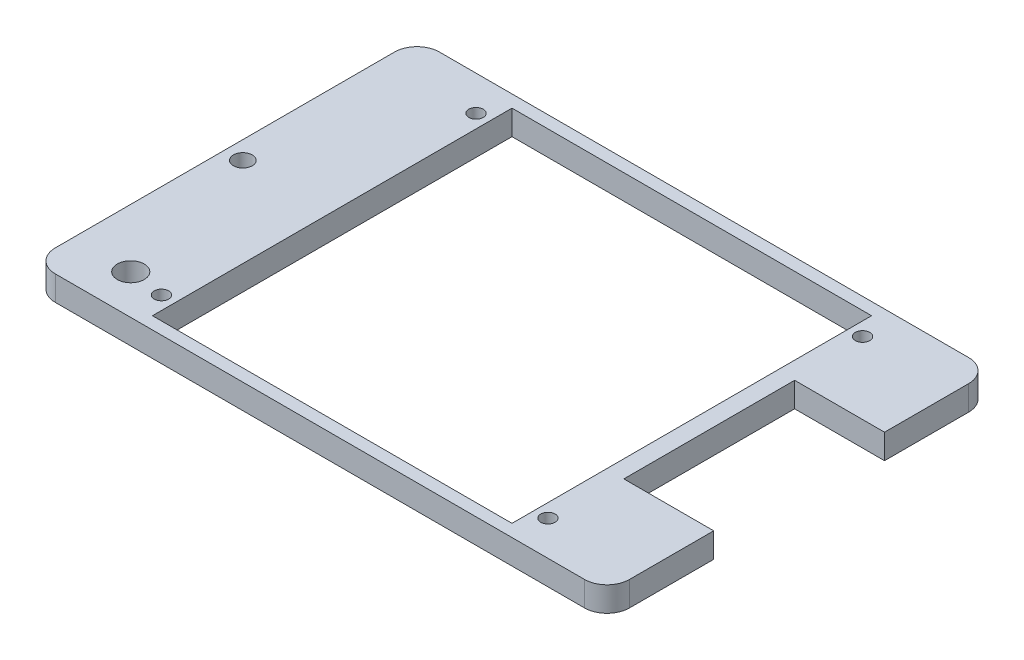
ISO-10303-21;
HEADER;
FILE_DESCRIPTION(('STEP AP214'),'2;1');
FILE_NAME('part.step','',(''),(''),'','','');
FILE_SCHEMA(('AUTOMOTIVE_DESIGN { 1 0 10303 214 1 1 1 1 }'));
ENDSEC;
DATA;
#1=APPLICATION_CONTEXT('core data for automotive mechanical design processes');
#2=APPLICATION_PROTOCOL_DEFINITION('international standard','automotive_design',2000,#1);
#3=PRODUCT_CONTEXT('',#1,'mechanical');
#4=PRODUCT('Part','Part','',(#3));
#5=PRODUCT_RELATED_PRODUCT_CATEGORY('part','',(#4));
#6=PRODUCT_DEFINITION_FORMATION('','',#4);
#7=PRODUCT_DEFINITION_CONTEXT('part definition',#1,'design');
#8=PRODUCT_DEFINITION('design','',#6,#7);
#9=PRODUCT_DEFINITION_SHAPE('','',#8);
#10=(LENGTH_UNIT() NAMED_UNIT(*) SI_UNIT(.MILLI.,.METRE.));
#11=(NAMED_UNIT(*) PLANE_ANGLE_UNIT() SI_UNIT($,.RADIAN.));
#12=(NAMED_UNIT(*) SI_UNIT($,.STERADIAN.) SOLID_ANGLE_UNIT());
#13=UNCERTAINTY_MEASURE_WITH_UNIT(LENGTH_MEASURE(1.E-05),#10,'distance_accuracy_value','');
#14=(GEOMETRIC_REPRESENTATION_CONTEXT(3) GLOBAL_UNCERTAINTY_ASSIGNED_CONTEXT((#13)) GLOBAL_UNIT_ASSIGNED_CONTEXT((#10,
#11,#12)) REPRESENTATION_CONTEXT('',''));
#15=CARTESIAN_POINT('',(0.,0.,0.));
#16=DIRECTION('',(0.,0.,1.));
#17=DIRECTION('',(1.,0.,0.));
#18=AXIS2_PLACEMENT_3D('',#15,#16,#17);
#19=CARTESIAN_POINT('',(0.,5.5,0.));
#20=DIRECTION('',(0.,1.,0.));
#21=DIRECTION('',(0.,0.,1.));
#22=AXIS2_PLACEMENT_3D('',#19,#20,#21);
#23=PLANE('',#22);
#24=CARTESIAN_POINT('',(-43.,5.5,35.));
#25=DIRECTION('',(0.,1.,0.));
#26=DIRECTION('',(0.,0.,-1.));
#27=AXIS2_PLACEMENT_3D('',#24,#25,#26);
#28=CIRCLE('',#27,1.6);
#29=CARTESIAN_POINT('',(-43.,5.5,33.4));
#30=VERTEX_POINT('',#29);
#31=EDGE_CURVE('E429',#30,#30,#28,.T.);
#32=ORIENTED_EDGE('',*,*,#31,.F.);
#33=EDGE_LOOP('',(#32));
#34=FACE_BOUND('',#33,.T.);
#35=CARTESIAN_POINT('',(43.,5.5,-35.));
#36=DIRECTION('',(0.,1.,0.));
#37=DIRECTION('',(0.,0.,1.));
#38=AXIS2_PLACEMENT_3D('',#35,#36,#37);
#39=CIRCLE('',#38,1.6);
#40=CARTESIAN_POINT('',(43.,5.5,-33.4));
#41=VERTEX_POINT('',#40);
#42=EDGE_CURVE('E445',#41,#41,#39,.T.);
#43=ORIENTED_EDGE('',*,*,#42,.F.);
#44=EDGE_LOOP('',(#43));
#45=FACE_BOUND('',#44,.T.);
#46=CARTESIAN_POINT('',(-59.88,5.5,0.));
#47=DIRECTION('',(0.,1.,0.));
#48=DIRECTION('',(0.,0.,1.));
#49=AXIS2_PLACEMENT_3D('',#46,#47,#48);
#50=CIRCLE('',#49,2.1);
#51=CARTESIAN_POINT('',(-59.88,5.5,2.09999999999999));
#52=VERTEX_POINT('',#51);
#53=EDGE_CURVE('E194',#52,#52,#50,.T.);
#54=ORIENTED_EDGE('',*,*,#53,.F.);
#55=EDGE_LOOP('',(#54));
#56=FACE_BOUND('',#55,.T.);
#57=DIRECTION('',(-1.,0.,0.));
#58=VECTOR('',#57,1.);
#59=CARTESIAN_POINT('',(-63.88,5.5,-42.74));
#60=LINE('',#59,#58);
#61=CARTESIAN_POINT('',(58.8799999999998,5.5,-42.74));
#62=VERTEX_POINT('',#61);
#63=CARTESIAN_POINT('',(-58.88,5.5,-42.74));
#64=VERTEX_POINT('',#63);
#65=EDGE_CURVE('E211',#62,#64,#60,.T.);
#66=ORIENTED_EDGE('',*,*,#65,.T.);
#67=CARTESIAN_POINT('',(-58.88,5.5,-37.74));
#68=DIRECTION('',(0.,1.,0.));
#69=DIRECTION('',(0.,0.,1.));
#70=AXIS2_PLACEMENT_3D('',#67,#68,#69);
#71=CIRCLE('',#70,5.);
#72=CARTESIAN_POINT('',(-63.88,5.5,-37.74));
#73=VERTEX_POINT('',#72);
#74=EDGE_CURVE('E318',#64,#73,#71,.T.);
#75=ORIENTED_EDGE('',*,*,#74,.T.);
#76=DIRECTION('',(0.,0.,1.));
#77=VECTOR('',#76,1.);
#78=CARTESIAN_POINT('',(-63.88,5.5,33.9411254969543));
#79=LINE('',#78,#77);
#80=CARTESIAN_POINT('',(-63.88,5.5,37.74));
#81=VERTEX_POINT('',#80);
#82=EDGE_CURVE('E215',#73,#81,#79,.T.);
#83=ORIENTED_EDGE('',*,*,#82,.T.);
#84=CARTESIAN_POINT('',(-58.88,5.5,37.74));
#85=DIRECTION('',(0.,1.,0.));
#86=DIRECTION('',(0.,0.,1.));
#87=AXIS2_PLACEMENT_3D('',#84,#85,#86);
#88=CIRCLE('',#87,5.);
#89=CARTESIAN_POINT('',(-58.88,5.5,42.74));
#90=VERTEX_POINT('',#89);
#91=EDGE_CURVE('E290',#81,#90,#88,.T.);
#92=ORIENTED_EDGE('',*,*,#91,.T.);
#93=DIRECTION('',(1.,0.,0.));
#94=VECTOR('',#93,1.);
#95=CARTESIAN_POINT('',(63.88,5.5,42.74));
#96=LINE('',#95,#94);
#97=CARTESIAN_POINT('',(58.88,5.5,42.74));
#98=VERTEX_POINT('',#97);
#99=EDGE_CURVE('E219',#90,#98,#96,.T.);
#100=ORIENTED_EDGE('',*,*,#99,.T.);
#101=CARTESIAN_POINT('',(58.88,5.5,37.74));
#102=DIRECTION('',(0.,1.,0.));
#103=DIRECTION('',(0.,0.,1.));
#104=AXIS2_PLACEMENT_3D('',#101,#102,#103);
#105=CIRCLE('',#104,5.);
#106=CARTESIAN_POINT('',(63.88,5.5,37.74));
#107=VERTEX_POINT('',#106);
#108=EDGE_CURVE('E63',#98,#107,#105,.T.);
#109=ORIENTED_EDGE('',*,*,#108,.T.);
#110=DIRECTION('',(0.,0.,-1.));
#111=VECTOR('',#110,1.);
#112=CARTESIAN_POINT('',(63.88,5.5,19.));
#113=LINE('',#112,#111);
#114=CARTESIAN_POINT('',(63.88,5.5,19.));
#115=VERTEX_POINT('',#114);
#116=EDGE_CURVE('E222',#107,#115,#113,.T.);
#117=ORIENTED_EDGE('',*,*,#116,.T.);
#118=DIRECTION('',(-1.,0.,0.));
#119=VECTOR('',#118,1.);
#120=CARTESIAN_POINT('',(43.88,5.5,19.));
#121=LINE('',#120,#119);
#122=CARTESIAN_POINT('',(43.88,5.5,19.));
#123=VERTEX_POINT('',#122);
#124=EDGE_CURVE('E225',#115,#123,#121,.T.);
#125=ORIENTED_EDGE('',*,*,#124,.T.);
#126=DIRECTION('',(0.,0.,-1.));
#127=VECTOR('',#126,1.);
#128=CARTESIAN_POINT('',(43.88,5.5,18.));
#129=LINE('',#128,#127);
#130=CARTESIAN_POINT('',(43.88,5.5,-19.));
#131=VERTEX_POINT('',#130);
#132=EDGE_CURVE('E228',#123,#131,#129,.T.);
#133=ORIENTED_EDGE('',*,*,#132,.T.);
#134=DIRECTION('',(1.,0.,0.));
#135=VECTOR('',#134,1.);
#136=CARTESIAN_POINT('',(43.88,5.5,-19.));
#137=LINE('',#136,#135);
#138=CARTESIAN_POINT('',(63.8799999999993,5.5,-19.));
#139=VERTEX_POINT('',#138);
#140=EDGE_CURVE('E231',#131,#139,#137,.T.);
#141=ORIENTED_EDGE('',*,*,#140,.T.);
#142=DIRECTION('',(0.,0.,-1.));
#143=VECTOR('',#142,1.);
#144=CARTESIAN_POINT('',(63.8799999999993,5.5,-19.));
#145=LINE('',#144,#143);
#146=CARTESIAN_POINT('',(63.8799999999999,5.5,-37.7399999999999));
#147=VERTEX_POINT('',#146);
#148=EDGE_CURVE('E234',#139,#147,#145,.T.);
#149=ORIENTED_EDGE('',*,*,#148,.T.);
#150=CARTESIAN_POINT('',(58.8799999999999,5.5,-37.74));
#151=DIRECTION('',(0.,1.,0.));
#152=DIRECTION('',(0.,0.,1.));
#153=AXIS2_PLACEMENT_3D('',#150,#151,#152);
#154=CIRCLE('',#153,5.);
#155=EDGE_CURVE('E315',#147,#62,#154,.T.);
#156=ORIENTED_EDGE('',*,*,#155,.T.);
#157=EDGE_LOOP('',(#66,#75,#83,#92,#100,#109,#117,#125,#133,#141,#149,#156));
#158=FACE_BOUND('',#157,.T.);
#159=DIRECTION('',(1.,0.,0.));
#160=VECTOR('',#159,1.);
#161=CARTESIAN_POINT('',(40.,5.5,40.));
#162=LINE('',#161,#160);
#163=CARTESIAN_POINT('',(-40.,5.5,40.));
#164=VERTEX_POINT('',#163);
#165=CARTESIAN_POINT('',(40.,5.5,40.));
#166=VERTEX_POINT('',#165);
#167=EDGE_CURVE('E181',#164,#166,#162,.T.);
#168=ORIENTED_EDGE('',*,*,#167,.F.);
#169=DIRECTION('',(0.,0.,1.));
#170=VECTOR('',#169,1.);
#171=CARTESIAN_POINT('',(-40.,5.5,40.));
#172=LINE('',#171,#170);
#173=CARTESIAN_POINT('',(-40.,5.5,-40.));
#174=VERTEX_POINT('',#173);
#175=EDGE_CURVE('E166',#174,#164,#172,.T.);
#176=ORIENTED_EDGE('',*,*,#175,.F.);
#177=DIRECTION('',(-1.,0.,0.));
#178=VECTOR('',#177,1.);
#179=CARTESIAN_POINT('',(-40.,5.5,-40.));
#180=LINE('',#179,#178);
#181=CARTESIAN_POINT('',(40.,5.5,-40.));
#182=VERTEX_POINT('',#181);
#183=EDGE_CURVE('E154',#182,#174,#180,.T.);
#184=ORIENTED_EDGE('',*,*,#183,.F.);
#185=DIRECTION('',(0.,0.,-1.));
#186=VECTOR('',#185,1.);
#187=CARTESIAN_POINT('',(40.,5.5,-40.));
#188=LINE('',#187,#186);
#189=EDGE_CURVE('E185',#166,#182,#188,.T.);
#190=ORIENTED_EDGE('',*,*,#189,.F.);
#191=EDGE_LOOP('',(#168,#176,#184,#190));
#192=FACE_BOUND('',#191,.T.);
#193=CARTESIAN_POINT('',(-50.88,5.5,33.9411254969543));
#194=DIRECTION('',(0.,1.,0.));
#195=DIRECTION('',(0.,0.,1.));
#196=AXIS2_PLACEMENT_3D('',#193,#194,#195);
#197=CIRCLE('',#196,3.);
#198=CARTESIAN_POINT('',(-50.88,5.5,36.9411254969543));
#199=VERTEX_POINT('',#198);
#200=EDGE_CURVE('E453',#199,#199,#197,.T.);
#201=ORIENTED_EDGE('',*,*,#200,.F.);
#202=EDGE_LOOP('',(#201));
#203=FACE_BOUND('',#202,.T.);
#204=CARTESIAN_POINT('',(43.,5.5,35.));
#205=DIRECTION('',(0.,1.,0.));
#206=DIRECTION('',(0.,0.,1.));
#207=AXIS2_PLACEMENT_3D('',#204,#205,#206);
#208=CIRCLE('',#207,1.6);
#209=CARTESIAN_POINT('',(43.,5.5,36.6));
#210=VERTEX_POINT('',#209);
#211=EDGE_CURVE('E437',#210,#210,#208,.T.);
#212=ORIENTED_EDGE('',*,*,#211,.F.);
#213=EDGE_LOOP('',(#212));
#214=FACE_BOUND('',#213,.T.);
#215=CARTESIAN_POINT('',(-43.,5.5,-35.));
#216=DIRECTION('',(0.,1.,0.));
#217=DIRECTION('',(0.,0.,-1.));
#218=AXIS2_PLACEMENT_3D('',#215,#216,#217);
#219=CIRCLE('',#218,1.6);
#220=CARTESIAN_POINT('',(-43.,5.5,-36.6));
#221=VERTEX_POINT('',#220);
#222=EDGE_CURVE('E418',#221,#221,#219,.T.);
#223=ORIENTED_EDGE('',*,*,#222,.F.);
#224=EDGE_LOOP('',(#223));
#225=FACE_BOUND('',#224,.T.);
#226=ADVANCED_FACE('F39',(#34,#45,#56,#158,#192,#203,#214,#225),#23,.T.);
#227=CARTESIAN_POINT('',(0.,0.,0.));
#228=DIRECTION('',(0.,1.,0.));
#229=DIRECTION('',(0.,0.,1.));
#230=AXIS2_PLACEMENT_3D('',#227,#228,#229);
#231=PLANE('',#230);
#232=DIRECTION('',(0.,0.,1.));
#233=VECTOR('',#232,1.);
#234=CARTESIAN_POINT('',(-63.88,0.,42.74));
#235=LINE('',#234,#233);
#236=CARTESIAN_POINT('',(-63.88,0.,-37.74));
#237=VERTEX_POINT('',#236);
#238=CARTESIAN_POINT('',(-63.88,0.,37.74));
#239=VERTEX_POINT('',#238);
#240=EDGE_CURVE('E176',#237,#239,#235,.T.);
#241=ORIENTED_EDGE('',*,*,#240,.F.);
#242=CARTESIAN_POINT('',(-58.88,0.,-37.74));
#243=DIRECTION('',(0.,1.,0.));
#244=DIRECTION('',(0.,0.,1.));
#245=AXIS2_PLACEMENT_3D('',#242,#243,#244);
#246=CIRCLE('',#245,5.);
#247=CARTESIAN_POINT('',(-58.88,0.,-42.74));
#248=VERTEX_POINT('',#247);
#249=EDGE_CURVE('E303',#237,#248,#246,.F.);
#250=ORIENTED_EDGE('',*,*,#249,.T.);
#251=DIRECTION('',(-1.,0.,0.));
#252=VECTOR('',#251,1.);
#253=CARTESIAN_POINT('',(0.,0.,-42.74));
#254=LINE('',#253,#252);
#255=CARTESIAN_POINT('',(58.8799999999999,0.,-42.74));
#256=VERTEX_POINT('',#255);
#257=EDGE_CURVE('E216',#256,#248,#254,.T.);
#258=ORIENTED_EDGE('',*,*,#257,.F.);
#259=CARTESIAN_POINT('',(58.8799999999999,0.,-37.74));
#260=DIRECTION('',(0.,1.,0.));
#261=DIRECTION('',(0.,0.,1.));
#262=AXIS2_PLACEMENT_3D('',#259,#260,#261);
#263=CIRCLE('',#262,5.);
#264=CARTESIAN_POINT('',(63.8799999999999,0.,-37.7399999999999));
#265=VERTEX_POINT('',#264);
#266=EDGE_CURVE('E300',#256,#265,#263,.F.);
#267=ORIENTED_EDGE('',*,*,#266,.T.);
#268=DIRECTION('',(0.,0.,-1.));
#269=VECTOR('',#268,1.);
#270=CARTESIAN_POINT('',(63.8799999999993,0.,-19.));
#271=LINE('',#270,#269);
#272=CARTESIAN_POINT('',(63.8799999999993,0.,-19.));
#273=VERTEX_POINT('',#272);
#274=EDGE_CURVE('E257',#273,#265,#271,.T.);
#275=ORIENTED_EDGE('',*,*,#274,.F.);
#276=DIRECTION('',(1.,0.,0.));
#277=VECTOR('',#276,1.);
#278=CARTESIAN_POINT('',(43.88,0.,-19.));
#279=LINE('',#278,#277);
#280=CARTESIAN_POINT('',(43.88,0.,-19.));
#281=VERTEX_POINT('',#280);
#282=EDGE_CURVE('E254',#281,#273,#279,.T.);
#283=ORIENTED_EDGE('',*,*,#282,.F.);
#284=DIRECTION('',(0.,0.,-1.));
#285=VECTOR('',#284,1.);
#286=CARTESIAN_POINT('',(43.88,0.,-18.));
#287=LINE('',#286,#285);
#288=CARTESIAN_POINT('',(43.88,0.,19.));
#289=VERTEX_POINT('',#288);
#290=EDGE_CURVE('E251',#289,#281,#287,.T.);
#291=ORIENTED_EDGE('',*,*,#290,.F.);
#292=DIRECTION('',(-1.,0.,0.));
#293=VECTOR('',#292,1.);
#294=CARTESIAN_POINT('',(43.88,0.,19.));
#295=LINE('',#294,#293);
#296=CARTESIAN_POINT('',(63.88,0.,19.));
#297=VERTEX_POINT('',#296);
#298=EDGE_CURVE('E247',#297,#289,#295,.T.);
#299=ORIENTED_EDGE('',*,*,#298,.F.);
#300=DIRECTION('',(0.,0.,-1.));
#301=VECTOR('',#300,1.);
#302=CARTESIAN_POINT('',(63.88,0.,19.));
#303=LINE('',#302,#301);
#304=CARTESIAN_POINT('',(63.88,0.,37.74));
#305=VERTEX_POINT('',#304);
#306=EDGE_CURVE('E244',#305,#297,#303,.T.);
#307=ORIENTED_EDGE('',*,*,#306,.F.);
#308=CARTESIAN_POINT('',(58.88,0.,37.74));
#309=DIRECTION('',(0.,1.,0.));
#310=DIRECTION('',(0.,0.,1.));
#311=AXIS2_PLACEMENT_3D('',#308,#309,#310);
#312=CIRCLE('',#311,5.);
#313=CARTESIAN_POINT('',(58.88,0.,42.74));
#314=VERTEX_POINT('',#313);
#315=EDGE_CURVE('E297',#305,#314,#312,.F.);
#316=ORIENTED_EDGE('',*,*,#315,.T.);
#317=DIRECTION('',(1.,0.,0.));
#318=VECTOR('',#317,1.);
#319=CARTESIAN_POINT('',(63.88,0.,42.74));
#320=LINE('',#319,#318);
#321=CARTESIAN_POINT('',(-58.88,0.,42.74));
#322=VERTEX_POINT('',#321);
#323=EDGE_CURVE('E240',#322,#314,#320,.T.);
#324=ORIENTED_EDGE('',*,*,#323,.F.);
#325=CARTESIAN_POINT('',(-58.88,0.,37.74));
#326=DIRECTION('',(0.,1.,0.));
#327=DIRECTION('',(0.,0.,1.));
#328=AXIS2_PLACEMENT_3D('',#325,#326,#327);
#329=CIRCLE('',#328,5.);
#330=EDGE_CURVE('E282',#322,#239,#329,.F.);
#331=ORIENTED_EDGE('',*,*,#330,.T.);
#332=EDGE_LOOP('',(#241,#250,#258,#267,#275,#283,#291,#299,#307,#316,#324,#331));
#333=FACE_BOUND('',#332,.T.);
#334=DIRECTION('',(0.,0.,1.));
#335=VECTOR('',#334,1.);
#336=CARTESIAN_POINT('',(-40.,0.,40.));
#337=LINE('',#336,#335);
#338=CARTESIAN_POINT('',(-40.,0.,-40.));
#339=VERTEX_POINT('',#338);
#340=CARTESIAN_POINT('',(-40.,0.,40.));
#341=VERTEX_POINT('',#340);
#342=EDGE_CURVE('E173',#339,#341,#337,.T.);
#343=ORIENTED_EDGE('',*,*,#342,.T.);
#344=DIRECTION('',(1.,0.,0.));
#345=VECTOR('',#344,1.);
#346=CARTESIAN_POINT('',(40.,0.,40.));
#347=LINE('',#346,#345);
#348=CARTESIAN_POINT('',(40.,0.,40.));
#349=VERTEX_POINT('',#348);
#350=EDGE_CURVE('E193',#341,#349,#347,.T.);
#351=ORIENTED_EDGE('',*,*,#350,.T.);
#352=DIRECTION('',(0.,0.,-1.));
#353=VECTOR('',#352,1.);
#354=CARTESIAN_POINT('',(40.,0.,-40.));
#355=LINE('',#354,#353);
#356=CARTESIAN_POINT('',(40.,0.,-40.));
#357=VERTEX_POINT('',#356);
#358=EDGE_CURVE('E198',#349,#357,#355,.T.);
#359=ORIENTED_EDGE('',*,*,#358,.T.);
#360=DIRECTION('',(-1.,0.,0.));
#361=VECTOR('',#360,1.);
#362=CARTESIAN_POINT('',(0.,0.,-40.));
#363=LINE('',#362,#361);
#364=EDGE_CURVE('E167',#357,#339,#363,.T.);
#365=ORIENTED_EDGE('',*,*,#364,.T.);
#366=EDGE_LOOP('',(#343,#351,#359,#365));
#367=FACE_BOUND('',#366,.T.);
#368=CARTESIAN_POINT('',(-59.88,0.,0.));
#369=DIRECTION('',(0.,1.,0.));
#370=DIRECTION('',(0.,0.,1.));
#371=AXIS2_PLACEMENT_3D('',#368,#369,#370);
#372=CIRCLE('',#371,2.1);
#373=CARTESIAN_POINT('',(-59.88,0.,2.09999999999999));
#374=VERTEX_POINT('',#373);
#375=EDGE_CURVE('E457',#374,#374,#372,.T.);
#376=ORIENTED_EDGE('',*,*,#375,.T.);
#377=EDGE_LOOP('',(#376));
#378=FACE_BOUND('',#377,.T.);
#379=CARTESIAN_POINT('',(-50.88,0.,33.9411254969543));
#380=DIRECTION('',(0.,1.,0.));
#381=DIRECTION('',(0.,0.,1.));
#382=AXIS2_PLACEMENT_3D('',#379,#380,#381);
#383=CIRCLE('',#382,3.);
#384=CARTESIAN_POINT('',(-50.88,0.,36.9411254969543));
#385=VERTEX_POINT('',#384);
#386=EDGE_CURVE('E449',#385,#385,#383,.T.);
#387=ORIENTED_EDGE('',*,*,#386,.T.);
#388=EDGE_LOOP('',(#387));
#389=FACE_BOUND('',#388,.T.);
#390=CARTESIAN_POINT('',(43.,0.,-35.));
#391=DIRECTION('',(0.,1.,0.));
#392=DIRECTION('',(0.,0.,1.));
#393=AXIS2_PLACEMENT_3D('',#390,#391,#392);
#394=CIRCLE('',#393,1.6);
#395=CARTESIAN_POINT('',(43.,0.,-33.4));
#396=VERTEX_POINT('',#395);
#397=EDGE_CURVE('E441',#396,#396,#394,.T.);
#398=ORIENTED_EDGE('',*,*,#397,.T.);
#399=EDGE_LOOP('',(#398));
#400=FACE_BOUND('',#399,.T.);
#401=CARTESIAN_POINT('',(43.,0.,35.));
#402=DIRECTION('',(0.,1.,0.));
#403=DIRECTION('',(0.,0.,1.));
#404=AXIS2_PLACEMENT_3D('',#401,#402,#403);
#405=CIRCLE('',#404,1.6);
#406=CARTESIAN_POINT('',(43.,0.,36.6));
#407=VERTEX_POINT('',#406);
#408=EDGE_CURVE('E433',#407,#407,#405,.T.);
#409=ORIENTED_EDGE('',*,*,#408,.T.);
#410=EDGE_LOOP('',(#409));
#411=FACE_BOUND('',#410,.T.);
#412=CARTESIAN_POINT('',(-43.,0.,35.));
#413=DIRECTION('',(0.,1.,0.));
#414=DIRECTION('',(0.,0.,-1.));
#415=AXIS2_PLACEMENT_3D('',#412,#413,#414);
#416=CIRCLE('',#415,1.6);
#417=CARTESIAN_POINT('',(-43.,0.,33.4));
#418=VERTEX_POINT('',#417);
#419=EDGE_CURVE('E426',#418,#418,#416,.T.);
#420=ORIENTED_EDGE('',*,*,#419,.T.);
#421=EDGE_LOOP('',(#420));
#422=FACE_BOUND('',#421,.T.);
#423=CARTESIAN_POINT('',(-43.,0.,-35.));
#424=DIRECTION('',(0.,1.,0.));
#425=DIRECTION('',(0.,0.,-1.));
#426=AXIS2_PLACEMENT_3D('',#423,#424,#425);
#427=CIRCLE('',#426,1.6);
#428=CARTESIAN_POINT('',(-43.,0.,-36.6));
#429=VERTEX_POINT('',#428);
#430=EDGE_CURVE('E421',#429,#429,#427,.T.);
#431=ORIENTED_EDGE('',*,*,#430,.T.);
#432=EDGE_LOOP('',(#431));
#433=FACE_BOUND('',#432,.T.);
#434=ADVANCED_FACE('F333',(#333,#367,#378,#389,#400,#411,#422,#433),#231,.F.);
#435=CARTESIAN_POINT('',(-63.88,5.5,42.74));
#436=DIRECTION('',(1.,0.,0.));
#437=DIRECTION('',(0.,0.,-1.));
#438=AXIS2_PLACEMENT_3D('',#435,#436,#437);
#439=PLANE('',#438);
#440=ORIENTED_EDGE('',*,*,#82,.F.);
#441=DIRECTION('',(0.,-1.,0.));
#442=VECTOR('',#441,1.);
#443=CARTESIAN_POINT('',(-63.88,5.5,-37.74));
#444=LINE('',#443,#442);
#445=EDGE_CURVE('E293',#73,#237,#444,.T.);
#446=ORIENTED_EDGE('',*,*,#445,.T.);
#447=ORIENTED_EDGE('',*,*,#240,.T.);
#448=DIRECTION('',(0.,-1.,0.));
#449=VECTOR('',#448,1.);
#450=CARTESIAN_POINT('',(-63.88,5.5,37.74));
#451=LINE('',#450,#449);
#452=EDGE_CURVE('E286',#239,#81,#451,.F.);
#453=ORIENTED_EDGE('',*,*,#452,.T.);
#454=EDGE_LOOP('',(#440,#446,#447,#453));
#455=FACE_BOUND('',#454,.T.);
#456=ADVANCED_FACE('F368',(#455),#439,.F.);
#457=CARTESIAN_POINT('',(63.88,5.5,42.74));
#458=DIRECTION('',(0.,0.,-1.));
#459=DIRECTION('',(-1.,0.,0.));
#460=AXIS2_PLACEMENT_3D('',#457,#458,#459);
#461=PLANE('',#460);
#462=ORIENTED_EDGE('',*,*,#323,.T.);
#463=DIRECTION('',(0.,-1.,0.));
#464=VECTOR('',#463,1.);
#465=CARTESIAN_POINT('',(58.88,5.5,42.74));
#466=LINE('',#465,#464);
#467=EDGE_CURVE('E11',#314,#98,#466,.F.);
#468=ORIENTED_EDGE('',*,*,#467,.T.);
#469=ORIENTED_EDGE('',*,*,#99,.F.);
#470=DIRECTION('',(0.,-1.,0.));
#471=VECTOR('',#470,1.);
#472=CARTESIAN_POINT('',(-58.88,5.5,42.74));
#473=LINE('',#472,#471);
#474=EDGE_CURVE('E278',#90,#322,#473,.T.);
#475=ORIENTED_EDGE('',*,*,#474,.T.);
#476=EDGE_LOOP('',(#462,#468,#469,#475));
#477=FACE_BOUND('',#476,.T.);
#478=ADVANCED_FACE('F513',(#477),#461,.F.);
#479=CARTESIAN_POINT('',(63.88,5.5,19.));
#480=DIRECTION('',(-1.,0.,0.));
#481=DIRECTION('',(0.,0.,1.));
#482=AXIS2_PLACEMENT_3D('',#479,#480,#481);
#483=PLANE('',#482);
#484=ORIENTED_EDGE('',*,*,#116,.F.);
#485=DIRECTION('',(0.,-1.,0.));
#486=VECTOR('',#485,1.);
#487=CARTESIAN_POINT('',(63.88,5.5,37.74));
#488=LINE('',#487,#486);
#489=EDGE_CURVE('E48',#107,#305,#488,.T.);
#490=ORIENTED_EDGE('',*,*,#489,.T.);
#491=ORIENTED_EDGE('',*,*,#306,.T.);
#492=DIRECTION('',(0.,-1.,0.));
#493=VECTOR('',#492,1.);
#494=CARTESIAN_POINT('',(63.88,5.5,19.));
#495=LINE('',#494,#493);
#496=EDGE_CURVE('E274',#115,#297,#495,.T.);
#497=ORIENTED_EDGE('',*,*,#496,.F.);
#498=EDGE_LOOP('',(#484,#490,#491,#497));
#499=FACE_BOUND('',#498,.T.);
#500=ADVANCED_FACE('F327',(#499),#483,.F.);
#501=CARTESIAN_POINT('',(43.88,5.5,19.));
#502=DIRECTION('',(0.,0.,1.));
#503=DIRECTION('',(1.,0.,0.));
#504=AXIS2_PLACEMENT_3D('',#501,#502,#503);
#505=PLANE('',#504);
#506=ORIENTED_EDGE('',*,*,#298,.T.);
#507=DIRECTION('',(0.,-1.,0.));
#508=VECTOR('',#507,1.);
#509=CARTESIAN_POINT('',(43.88,5.5,19.));
#510=LINE('',#509,#508);
#511=EDGE_CURVE('E270',#123,#289,#510,.T.);
#512=ORIENTED_EDGE('',*,*,#511,.F.);
#513=ORIENTED_EDGE('',*,*,#124,.F.);
#514=ORIENTED_EDGE('',*,*,#496,.T.);
#515=EDGE_LOOP('',(#506,#512,#513,#514));
#516=FACE_BOUND('',#515,.T.);
#517=ADVANCED_FACE('F339',(#516),#505,.F.);
#518=CARTESIAN_POINT('',(43.88,5.5,-18.));
#519=DIRECTION('',(-1.,0.,0.));
#520=DIRECTION('',(0.,0.,1.));
#521=AXIS2_PLACEMENT_3D('',#518,#519,#520);
#522=PLANE('',#521);
#523=ORIENTED_EDGE('',*,*,#290,.T.);
#524=DIRECTION('',(0.,-1.,0.));
#525=VECTOR('',#524,1.);
#526=CARTESIAN_POINT('',(43.88,5.5,-19.));
#527=LINE('',#526,#525);
#528=EDGE_CURVE('E266',#131,#281,#527,.T.);
#529=ORIENTED_EDGE('',*,*,#528,.F.);
#530=ORIENTED_EDGE('',*,*,#132,.F.);
#531=ORIENTED_EDGE('',*,*,#511,.T.);
#532=EDGE_LOOP('',(#523,#529,#530,#531));
#533=FACE_BOUND('',#532,.T.);
#534=ADVANCED_FACE('F343',(#533),#522,.F.);
#535=CARTESIAN_POINT('',(43.88,5.5,-19.));
#536=DIRECTION('',(0.,0.,-1.));
#537=DIRECTION('',(-1.,0.,0.));
#538=AXIS2_PLACEMENT_3D('',#535,#536,#537);
#539=PLANE('',#538);
#540=ORIENTED_EDGE('',*,*,#282,.T.);
#541=DIRECTION('',(0.,-1.,0.));
#542=VECTOR('',#541,1.);
#543=CARTESIAN_POINT('',(63.8799999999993,5.5,-19.));
#544=LINE('',#543,#542);
#545=EDGE_CURVE('E237',#139,#273,#544,.T.);
#546=ORIENTED_EDGE('',*,*,#545,.F.);
#547=ORIENTED_EDGE('',*,*,#140,.F.);
#548=ORIENTED_EDGE('',*,*,#528,.T.);
#549=EDGE_LOOP('',(#540,#546,#547,#548));
#550=FACE_BOUND('',#549,.T.);
#551=ADVANCED_FACE('F349',(#550),#539,.F.);
#552=CARTESIAN_POINT('',(63.8799999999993,5.5,-19.));
#553=DIRECTION('',(-1.,0.,0.));
#554=DIRECTION('',(0.,0.,1.));
#555=AXIS2_PLACEMENT_3D('',#552,#553,#554);
#556=PLANE('',#555);
#557=ORIENTED_EDGE('',*,*,#274,.T.);
#558=DIRECTION('',(0.,-1.,0.));
#559=VECTOR('',#558,1.);
#560=CARTESIAN_POINT('',(63.8799999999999,5.5,-37.7399999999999));
#561=LINE('',#560,#559);
#562=EDGE_CURVE('E55',#265,#147,#561,.F.);
#563=ORIENTED_EDGE('',*,*,#562,.T.);
#564=ORIENTED_EDGE('',*,*,#148,.F.);
#565=ORIENTED_EDGE('',*,*,#545,.T.);
#566=EDGE_LOOP('',(#557,#563,#564,#565));
#567=FACE_BOUND('',#566,.T.);
#568=ADVANCED_FACE('F351',(#567),#556,.F.);
#569=CARTESIAN_POINT('',(0.,5.5,-42.74));
#570=DIRECTION('',(0.,0.,1.));
#571=DIRECTION('',(1.,0.,0.));
#572=AXIS2_PLACEMENT_3D('',#569,#570,#571);
#573=PLANE('',#572);
#574=ORIENTED_EDGE('',*,*,#257,.T.);
#575=DIRECTION('',(0.,-1.,0.));
#576=VECTOR('',#575,1.);
#577=CARTESIAN_POINT('',(-58.88,5.5,-42.74));
#578=LINE('',#577,#576);
#579=EDGE_CURVE('E310',#248,#64,#578,.F.);
#580=ORIENTED_EDGE('',*,*,#579,.T.);
#581=ORIENTED_EDGE('',*,*,#65,.F.);
#582=DIRECTION('',(0.,-1.,0.));
#583=VECTOR('',#582,1.);
#584=CARTESIAN_POINT('',(58.8799999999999,5.5,-42.74));
#585=LINE('',#584,#583);
#586=EDGE_CURVE('E306',#62,#256,#585,.T.);
#587=ORIENTED_EDGE('',*,*,#586,.T.);
#588=EDGE_LOOP('',(#574,#580,#581,#587));
#589=FACE_BOUND('',#588,.T.);
#590=ADVANCED_FACE('F353',(#589),#573,.F.);
#591=CARTESIAN_POINT('',(-40.,5.5,40.));
#592=DIRECTION('',(1.,0.,0.));
#593=DIRECTION('',(0.,0.,-1.));
#594=AXIS2_PLACEMENT_3D('',#591,#592,#593);
#595=PLANE('',#594);
#596=ORIENTED_EDGE('',*,*,#342,.F.);
#597=DIRECTION('',(0.,-1.,0.));
#598=VECTOR('',#597,1.);
#599=CARTESIAN_POINT('',(-40.,5.5,-40.));
#600=LINE('',#599,#598);
#601=EDGE_CURVE('E158',#174,#339,#600,.T.);
#602=ORIENTED_EDGE('',*,*,#601,.F.);
#603=ORIENTED_EDGE('',*,*,#175,.T.);
#604=DIRECTION('',(0.,-1.,0.));
#605=VECTOR('',#604,1.);
#606=CARTESIAN_POINT('',(-40.,5.5,40.));
#607=LINE('',#606,#605);
#608=EDGE_CURVE('E177',#164,#341,#607,.T.);
#609=ORIENTED_EDGE('',*,*,#608,.T.);
#610=EDGE_LOOP('',(#596,#602,#603,#609));
#611=FACE_BOUND('',#610,.T.);
#612=ADVANCED_FACE('F170',(#611),#595,.T.);
#613=CARTESIAN_POINT('',(40.,5.5,40.));
#614=DIRECTION('',(0.,0.,-1.));
#615=DIRECTION('',(-1.,0.,0.));
#616=AXIS2_PLACEMENT_3D('',#613,#614,#615);
#617=PLANE('',#616);
#618=ORIENTED_EDGE('',*,*,#350,.F.);
#619=ORIENTED_EDGE('',*,*,#608,.F.);
#620=ORIENTED_EDGE('',*,*,#167,.T.);
#621=DIRECTION('',(0.,-1.,0.));
#622=VECTOR('',#621,1.);
#623=CARTESIAN_POINT('',(40.,5.5,40.));
#624=LINE('',#623,#622);
#625=EDGE_CURVE('E206',#166,#349,#624,.T.);
#626=ORIENTED_EDGE('',*,*,#625,.T.);
#627=EDGE_LOOP('',(#618,#619,#620,#626));
#628=FACE_BOUND('',#627,.T.);
#629=ADVANCED_FACE('F375',(#628),#617,.T.);
#630=CARTESIAN_POINT('',(40.,5.5,-40.));
#631=DIRECTION('',(-1.,0.,0.));
#632=DIRECTION('',(0.,0.,1.));
#633=AXIS2_PLACEMENT_3D('',#630,#631,#632);
#634=PLANE('',#633);
#635=ORIENTED_EDGE('',*,*,#358,.F.);
#636=ORIENTED_EDGE('',*,*,#625,.F.);
#637=ORIENTED_EDGE('',*,*,#189,.T.);
#638=DIRECTION('',(0.,-1.,0.));
#639=VECTOR('',#638,1.);
#640=CARTESIAN_POINT('',(40.,5.5,-40.));
#641=LINE('',#640,#639);
#642=EDGE_CURVE('E160',#182,#357,#641,.T.);
#643=ORIENTED_EDGE('',*,*,#642,.T.);
#644=EDGE_LOOP('',(#635,#636,#637,#643));
#645=FACE_BOUND('',#644,.T.);
#646=ADVANCED_FACE('F378',(#645),#634,.T.);
#647=CARTESIAN_POINT('',(0.,5.5,-40.));
#648=DIRECTION('',(0.,0.,1.));
#649=DIRECTION('',(1.,0.,0.));
#650=AXIS2_PLACEMENT_3D('',#647,#648,#649);
#651=PLANE('',#650);
#652=ORIENTED_EDGE('',*,*,#364,.F.);
#653=ORIENTED_EDGE('',*,*,#642,.F.);
#654=ORIENTED_EDGE('',*,*,#183,.T.);
#655=ORIENTED_EDGE('',*,*,#601,.T.);
#656=EDGE_LOOP('',(#652,#653,#654,#655));
#657=FACE_BOUND('',#656,.T.);
#658=ADVANCED_FACE('F157',(#657),#651,.T.);
#659=CARTESIAN_POINT('',(-59.88,5.5,0.));
#660=DIRECTION('',(0.,-1.,0.));
#661=DIRECTION('',(0.,0.,-1.));
#662=AXIS2_PLACEMENT_3D('',#659,#660,#661);
#663=CYLINDRICAL_SURFACE('',#662,2.1);
#664=ORIENTED_EDGE('',*,*,#53,.T.);
#665=EDGE_LOOP('',(#664));
#666=FACE_BOUND('',#665,.T.);
#667=ORIENTED_EDGE('',*,*,#375,.F.);
#668=EDGE_LOOP('',(#667));
#669=FACE_BOUND('',#668,.T.);
#670=ADVANCED_FACE('F385',(#666,#669),#663,.F.);
#671=CARTESIAN_POINT('',(-50.88,5.5,33.9411254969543));
#672=DIRECTION('',(0.,-1.,0.));
#673=DIRECTION('',(0.,0.,-1.));
#674=AXIS2_PLACEMENT_3D('',#671,#672,#673);
#675=CYLINDRICAL_SURFACE('',#674,3.);
#676=ORIENTED_EDGE('',*,*,#200,.T.);
#677=EDGE_LOOP('',(#676));
#678=FACE_BOUND('',#677,.T.);
#679=ORIENTED_EDGE('',*,*,#386,.F.);
#680=EDGE_LOOP('',(#679));
#681=FACE_BOUND('',#680,.T.);
#682=ADVANCED_FACE('F388',(#678,#681),#675,.F.);
#683=CARTESIAN_POINT('',(43.,5.5,-35.));
#684=DIRECTION('',(0.,-1.,0.));
#685=DIRECTION('',(0.,0.,-1.));
#686=AXIS2_PLACEMENT_3D('',#683,#684,#685);
#687=CYLINDRICAL_SURFACE('',#686,1.6);
#688=ORIENTED_EDGE('',*,*,#42,.T.);
#689=EDGE_LOOP('',(#688));
#690=FACE_BOUND('',#689,.T.);
#691=ORIENTED_EDGE('',*,*,#397,.F.);
#692=EDGE_LOOP('',(#691));
#693=FACE_BOUND('',#692,.T.);
#694=ADVANCED_FACE('F392',(#690,#693),#687,.F.);
#695=CARTESIAN_POINT('',(43.,5.5,35.));
#696=DIRECTION('',(0.,-1.,0.));
#697=DIRECTION('',(0.,0.,-1.));
#698=AXIS2_PLACEMENT_3D('',#695,#696,#697);
#699=CYLINDRICAL_SURFACE('',#698,1.6);
#700=ORIENTED_EDGE('',*,*,#211,.T.);
#701=EDGE_LOOP('',(#700));
#702=FACE_BOUND('',#701,.T.);
#703=ORIENTED_EDGE('',*,*,#408,.F.);
#704=EDGE_LOOP('',(#703));
#705=FACE_BOUND('',#704,.T.);
#706=ADVANCED_FACE('F396',(#702,#705),#699,.F.);
#707=CARTESIAN_POINT('',(-43.,5.5,35.));
#708=DIRECTION('',(0.,-1.,0.));
#709=DIRECTION('',(0.,0.,-1.));
#710=AXIS2_PLACEMENT_3D('',#707,#708,#709);
#711=CYLINDRICAL_SURFACE('',#710,1.6);
#712=ORIENTED_EDGE('',*,*,#31,.T.);
#713=EDGE_LOOP('',(#712));
#714=FACE_BOUND('',#713,.T.);
#715=ORIENTED_EDGE('',*,*,#419,.F.);
#716=EDGE_LOOP('',(#715));
#717=FACE_BOUND('',#716,.T.);
#718=ADVANCED_FACE('F400',(#714,#717),#711,.F.);
#719=CARTESIAN_POINT('',(-43.,5.5,-35.));
#720=DIRECTION('',(0.,-1.,0.));
#721=DIRECTION('',(0.,0.,-1.));
#722=AXIS2_PLACEMENT_3D('',#719,#720,#721);
#723=CYLINDRICAL_SURFACE('',#722,1.6);
#724=ORIENTED_EDGE('',*,*,#222,.T.);
#725=EDGE_LOOP('',(#724));
#726=FACE_BOUND('',#725,.T.);
#727=ORIENTED_EDGE('',*,*,#430,.F.);
#728=EDGE_LOOP('',(#727));
#729=FACE_BOUND('',#728,.T.);
#730=ADVANCED_FACE('F404',(#726,#729),#723,.F.);
#731=CARTESIAN_POINT('',(-58.88,5.5,37.74));
#732=DIRECTION('',(0.,-1.,0.));
#733=DIRECTION('',(0.,0.,-1.));
#734=AXIS2_PLACEMENT_3D('',#731,#732,#733);
#735=CYLINDRICAL_SURFACE('',#734,5.);
#736=ORIENTED_EDGE('',*,*,#91,.F.);
#737=ORIENTED_EDGE('',*,*,#452,.F.);
#738=ORIENTED_EDGE('',*,*,#330,.F.);
#739=ORIENTED_EDGE('',*,*,#474,.F.);
#740=EDGE_LOOP('',(#736,#737,#738,#739));
#741=FACE_BOUND('',#740,.T.);
#742=ADVANCED_FACE('F407',(#741),#735,.T.);
#743=CARTESIAN_POINT('',(-58.88,5.5,-37.74));
#744=DIRECTION('',(0.,-1.,0.));
#745=DIRECTION('',(0.,0.,-1.));
#746=AXIS2_PLACEMENT_3D('',#743,#744,#745);
#747=CYLINDRICAL_SURFACE('',#746,5.);
#748=ORIENTED_EDGE('',*,*,#74,.F.);
#749=ORIENTED_EDGE('',*,*,#579,.F.);
#750=ORIENTED_EDGE('',*,*,#249,.F.);
#751=ORIENTED_EDGE('',*,*,#445,.F.);
#752=EDGE_LOOP('',(#748,#749,#750,#751));
#753=FACE_BOUND('',#752,.T.);
#754=ADVANCED_FACE('F412',(#753),#747,.T.);
#755=CARTESIAN_POINT('',(58.8799999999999,5.5,-37.74));
#756=DIRECTION('',(0.,-1.,0.));
#757=DIRECTION('',(0.,0.,-1.));
#758=AXIS2_PLACEMENT_3D('',#755,#756,#757);
#759=CYLINDRICAL_SURFACE('',#758,5.);
#760=ORIENTED_EDGE('',*,*,#155,.F.);
#761=ORIENTED_EDGE('',*,*,#562,.F.);
#762=ORIENTED_EDGE('',*,*,#266,.F.);
#763=ORIENTED_EDGE('',*,*,#586,.F.);
#764=EDGE_LOOP('',(#760,#761,#762,#763));
#765=FACE_BOUND('',#764,.T.);
#766=ADVANCED_FACE('F490',(#765),#759,.T.);
#767=CARTESIAN_POINT('',(58.88,5.5,37.74));
#768=DIRECTION('',(0.,-1.,0.));
#769=DIRECTION('',(0.,0.,-1.));
#770=AXIS2_PLACEMENT_3D('',#767,#768,#769);
#771=CYLINDRICAL_SURFACE('',#770,5.);
#772=ORIENTED_EDGE('',*,*,#108,.F.);
#773=ORIENTED_EDGE('',*,*,#467,.F.);
#774=ORIENTED_EDGE('',*,*,#315,.F.);
#775=ORIENTED_EDGE('',*,*,#489,.F.);
#776=EDGE_LOOP('',(#772,#773,#774,#775));
#777=FACE_BOUND('',#776,.T.);
#778=ADVANCED_FACE('F41',(#777),#771,.T.);
#779=CLOSED_SHELL('',(#226,#434,#456,#478,#500,#517,#534,#551,#568,#590,#612,#629,#646,#658,
#670,#682,#694,#706,#718,#730,#742,#754,#766,#778));
#780=MANIFOLD_SOLID_BREP('B2',#779);
#781=ADVANCED_BREP_SHAPE_REPRESENTATION('',(#18,#780),#14);
#782=SHAPE_DEFINITION_REPRESENTATION(#9,#781);
ENDSEC;
END-ISO-10303-21;
